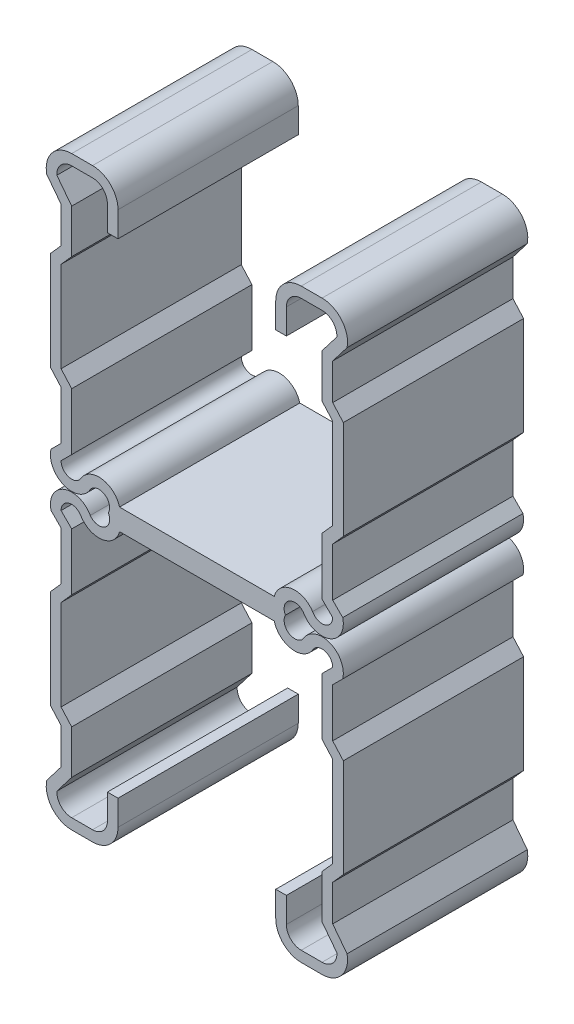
from build123d import *

# Parameters (mm, degrees)
BASE_EXTRUDE_DEPTH = 12.7


with BuildPart() as part:
    # Sketch1 → Base-Extrude (new, symmetric)
    with BuildSketch(Plane.XY):
        with BuildLine():
            Line((17.6403, 16.339286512), (19.729882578, 19.063533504))
            ThreePointArc((19.729882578, 19.063533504), (19.156045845, 20.609744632), (17.6403, 21.2598))
            Line((17.6403, 21.2598), (14.70327367, 21.2598))
            ThreePointArc((14.70327367, 21.2598), (13.223883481, 20.647016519), (12.6111, 19.16762633))
            Line((12.6111, 19.16762633), (12.6111, 15.61465))
            Line((12.6111, 15.61465), (11.1125, 15.61465))
            Line((11.1125, 15.61465), (11.1125, 19.16762633))
            ThreePointArc((11.1125, 19.16762633), (12.164213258, 21.706686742), (14.70327367, 22.7584))
            Line((14.70327367, 22.7584), (17.6403, 22.7584))
            ThreePointArc((17.6403, 22.7584), (20.415434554, 21.446284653), (21.162428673, 18.4688666))
            Line((21.162428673, 18.4688666), (19.1389, 15.830735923))
            Line((19.1389, 15.830735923), (19.1389, 10.749129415))
            Line((19.1389, 10.749129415), (20.6375, 9.0662125))
            Line((20.6375, 9.0662125), (20.6375, -4.8244125))
            Line((20.6375, -4.8244125), (19.1389, -6.507329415))
            Line((19.1389, -6.507329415), (19.1389, -13.358784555))
            Line((19.1389, -13.358784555), (20.553458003, -14.773342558))
            ThreePointArc((20.553458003, -14.773342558), (18.729942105, -18.270236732), (15.019825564, -16.932883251))
            ThreePointArc((15.019825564, -16.932883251), (13.000752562, -16.523120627), (12.480559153, -18.5166))
            Line((12.480559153, -18.5166), (-12.480559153, -18.5166))
            ThreePointArc((-12.480559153, -18.5166), (-13.000752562, -16.523120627), (-15.019825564, -16.932883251))
            ThreePointArc((-15.019825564, -16.932883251), (-18.729942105, -18.270236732), (-20.553458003, -14.773342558))
            Line((-20.553458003, -14.773342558), (-19.1389, -13.358784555))
            Line((-19.1389, -13.358784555), (-19.1389, -6.507329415))
            Line((-19.1389, -6.507329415), (-20.6375, -4.8244125))
            Line((-20.6375, -4.8244125), (-20.6375, 9.0662125))
            Line((-20.6375, 9.0662125), (-19.1389, 10.749129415))
            Line((-19.1389, 10.749129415), (-19.1389, 15.830735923))
            Line((-19.1389, 15.830735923), (-21.162428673, 18.4688666))
            ThreePointArc((-21.162428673, 18.4688666), (-20.415434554, 21.446284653), (-17.6403, 22.7584))
            Line((-17.6403, 22.7584), (-14.70327367, 22.7584))
            ThreePointArc((-14.70327367, 22.7584), (-12.164213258, 21.706686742), (-11.1125, 19.16762633))
            Line((-11.1125, 19.16762633), (-11.1125, 15.61465))
            Line((-11.1125, 15.61465), (-12.6111, 15.61465))
            Line((-12.6111, 15.61465), (-12.6111, 19.16762633))
            ThreePointArc((-12.6111, 19.16762633), (-13.223883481, 20.647016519), (-14.70327367, 21.2598))
            Line((-14.70327367, 21.2598), (-17.6403, 21.2598))
            ThreePointArc((-17.6403, 21.2598), (-19.156045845, 20.609744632), (-19.729882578, 19.063533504))
            Line((-19.729882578, 19.063533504), (-17.6403, 16.339286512))
            Line((-17.6403, 16.339286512), (-17.6403, 10.17860201))
            Line((-17.6403, 10.17860201), (-19.1389, 8.495685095))
            Line((-19.1389, 8.495685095), (-19.1389, -4.253885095))
            Line((-19.1389, -4.253885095), (-17.6403, -5.93680201))
            Line((-17.6403, -5.93680201), (-17.6403, -13.979525))
            Line((-17.6403, -13.979525), (-19.1389, -15.478125))
            ThreePointArc((-19.1389, -15.478125), (-18.092238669, -16.906954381), (-16.414285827, -16.33992034))
            ThreePointArc((-16.414285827, -16.33992034), (-13.428073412, -14.819877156), (-10.898992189, -17.018))
            Line((-10.898992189, -17.018), (10.898992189, -17.018))
            ThreePointArc((10.898992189, -17.018), (13.323359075, -14.834630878), (16.30518861, -16.15877141))
            ThreePointArc((16.30518861, -16.15877141), (17.990302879, -16.935279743), (19.1389, -15.478125))
            Line((19.1389, -15.478125), (17.6403, -13.979525))
            Line((17.6403, -13.979525), (17.6403, -5.93680201))
            Line((17.6403, -5.93680201), (19.1389, -4.253885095))
            Line((19.1389, -4.253885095), (19.1389, 8.495685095))
            Line((19.1389, 8.495685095), (17.6403, 10.17860201))
            Line((17.6403, 10.17860201), (17.6403, 16.339286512))
        make_face()
    base_extrude = extrude(amount=BASE_EXTRUDE_DEPTH, both=True)

    # Mirror1: Base-Extrude across plane
    add(base_extrude.mirror(Plane(origin=(0, -18.5166, 0), x_dir=(0, 0, 1), z_dir=(0, -1, 0))))


solid = part.part
